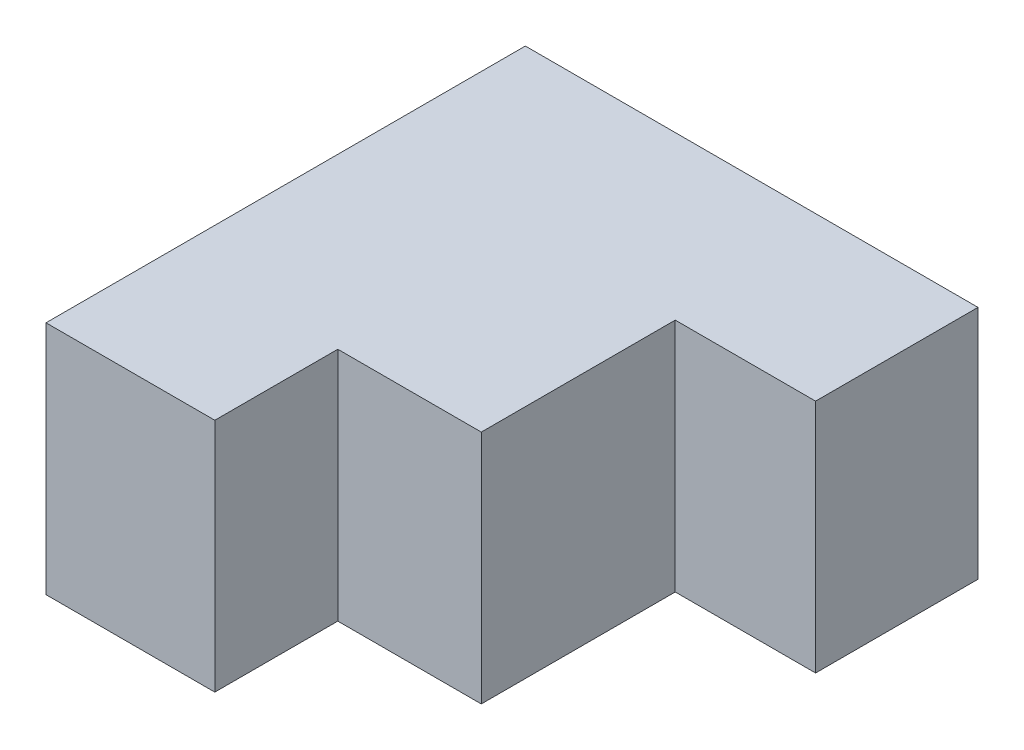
from build123d import *

# Parameters (mm, degrees)
BOSS_EXTRUDE1_DEPTH = 40


with BuildPart() as part:
    # Sketch1 → Boss-Extrude1 (new body)
    with BuildSketch(Plane(origin=(0, 0, 0), x_dir=(1, 0, 0), z_dir=(0, 1, 0))):
        Polygon((0, 0), (0, 81.431265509), (76.893229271, 81.431265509), (76.893229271, 53.841066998), (53.05315483, 53.841066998), (53.05315483, 20.893548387), (28.677348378, 20.893548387), (28.677348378, 0), align=None)
    extrude(amount=BOSS_EXTRUDE1_DEPTH)


solid = part.part
